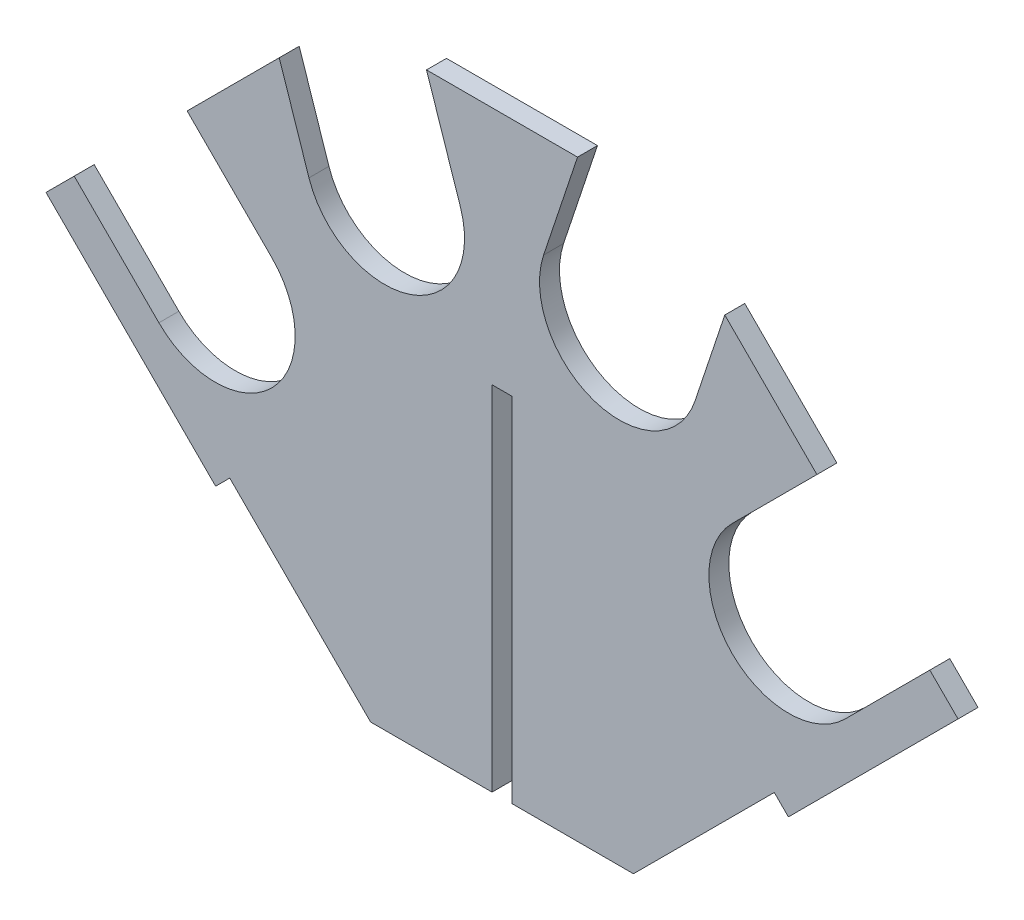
from build123d import *

# Parameters (mm, degrees)
SKETCH1_R          = 50.8
EXTRUDE1_DEPTH     = 12.7
CUT_EXTRUDE1_REACH = 561.991


with BuildPart() as part:
    # Sketch1 → Extrude1 (new body)
    with BuildSketch(Plane.XY):
        Polygon((182.235378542, 182.235378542), (290.185378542, 290.185378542), (101.6, 478.770757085), (-101.6, 478.770757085), (-290.185378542, 290.185378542), (-182.235378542, 182.235378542), (-173.255122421, 191.215634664), (-83.639487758, 101.6), (-6.35, 101.6), (-6.35, 326.106403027), (6.35, 326.106403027), (6.35, 101.6), (83.639487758, 101.6), (173.255122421, 191.215634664), align=None)
        with Locations((182.42230509, 290.185378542)):
            Circle(SKETCH1_R, mode=Mode.SUBTRACT)
        with Locations((74.659231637, 397.948451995)):
            Circle(SKETCH1_R, mode=Mode.SUBTRACT)
        with Locations((-74.659231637, 397.948451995)):
            Circle(SKETCH1_R, mode=Mode.SUBTRACT)
        with Locations((-182.42230509, 290.185378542)):
            Circle(SKETCH1_R, mode=Mode.SUBTRACT)
    extrude(amount=EXTRUDE1_DEPTH)

    # Sketch2 → Cut-Extrude1 (cut, up to next)
    with BuildSketch(Plane.XY.offset(12.7), mode=Mode.PRIVATE) as cut_extrude1_sk1:
        with BuildLine():
            Line((272.2248663, 308.145890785), (218.343329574, 254.264354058))
            ThreePointArc((218.343329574, 254.264354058), (218.343329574, 326.106403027), (146.501280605, 326.106403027))
            Line((146.501280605, 326.106403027), (200.382817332, 379.987939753))
            Line((200.382817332, 379.987939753), (272.2248663, 308.145890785))
        make_face()
    cut_extrude1_tool1 = extrude(cut_extrude1_sk1.sketch, amount=-CUT_EXTRUDE1_REACH, mode=Mode.PRIVATE) & part.part
    # Sketch2 → Cut-Extrude1 (cut, up to next)
    with BuildSketch(Plane.XY.offset(12.7), mode=Mode.PRIVATE) as cut_extrude1_sk2:
        with BuildLine():
            Line((141.760926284, 438.609830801), (122.852343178, 381.884081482))
            ThreePointArc((122.852343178, 381.884081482), (90.72360215, 446.141563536), (26.466120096, 414.012822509))
            Line((26.466120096, 414.012822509), (48.052098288, 478.770757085))
            Line((48.052098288, 478.770757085), (101.6, 478.770757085))
            Line((101.6, 478.770757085), (141.760926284, 438.609830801))
        make_face()
    cut_extrude1_tool2 = extrude(cut_extrude1_sk2.sketch, amount=-CUT_EXTRUDE1_REACH, mode=Mode.PRIVATE) & part.part
    # Sketch2 → Cut-Extrude1 (cut, up to next)
    with BuildSketch(Plane.XY.offset(12.7), mode=Mode.PRIVATE) as cut_extrude1_sk3:
        with BuildLine():
            Line((-48.052098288, 478.770757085), (-26.466120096, 414.012822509))
            ThreePointArc((-26.466120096, 414.012822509), (-90.72360215, 446.141563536), (-122.852343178, 381.884081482))
            Line((-122.852343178, 381.884081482), (-141.760926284, 438.609830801))
            Line((-141.760926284, 438.609830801), (-101.6, 478.770757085))
            Line((-101.6, 478.770757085), (-48.052098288, 478.770757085))
        make_face()
    cut_extrude1_tool3 = extrude(cut_extrude1_sk3.sketch, amount=-CUT_EXTRUDE1_REACH, mode=Mode.PRIVATE) & part.part
    # Sketch2 → Cut-Extrude1 (cut, up to next)
    with BuildSketch(Plane.XY.offset(12.7), mode=Mode.PRIVATE) as cut_extrude1_sk4:
        with BuildLine():
            Line((-200.382817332, 379.987939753), (-146.501280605, 326.106403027))
            ThreePointArc((-146.501280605, 326.106403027), (-218.343329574, 326.106403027), (-218.343329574, 254.264354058))
            Line((-218.343329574, 254.264354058), (-272.2248663, 308.145890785))
            Line((-272.2248663, 308.145890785), (-200.382817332, 379.987939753))
        make_face()
    cut_extrude1_tool4 = extrude(cut_extrude1_sk4.sketch, amount=-CUT_EXTRUDE1_REACH, mode=Mode.PRIVATE) & part.part
    add(cut_extrude1_tool1.solids().sort_by_distance((222.217162, 329.980235, 12.7))[0], mode=Mode.SUBTRACT)
    add(cut_extrude1_tool2.solids().sort_by_distance((90.417295, 451.753006, 12.7))[0], mode=Mode.SUBTRACT)
    add(cut_extrude1_tool3.solids().sort_by_distance((-90.417295, 451.753006, 12.7))[0], mode=Mode.SUBTRACT)
    add(cut_extrude1_tool4.solids().sort_by_distance((-222.217162, 329.980235, 12.7))[0], mode=Mode.SUBTRACT)


solid = part.part
